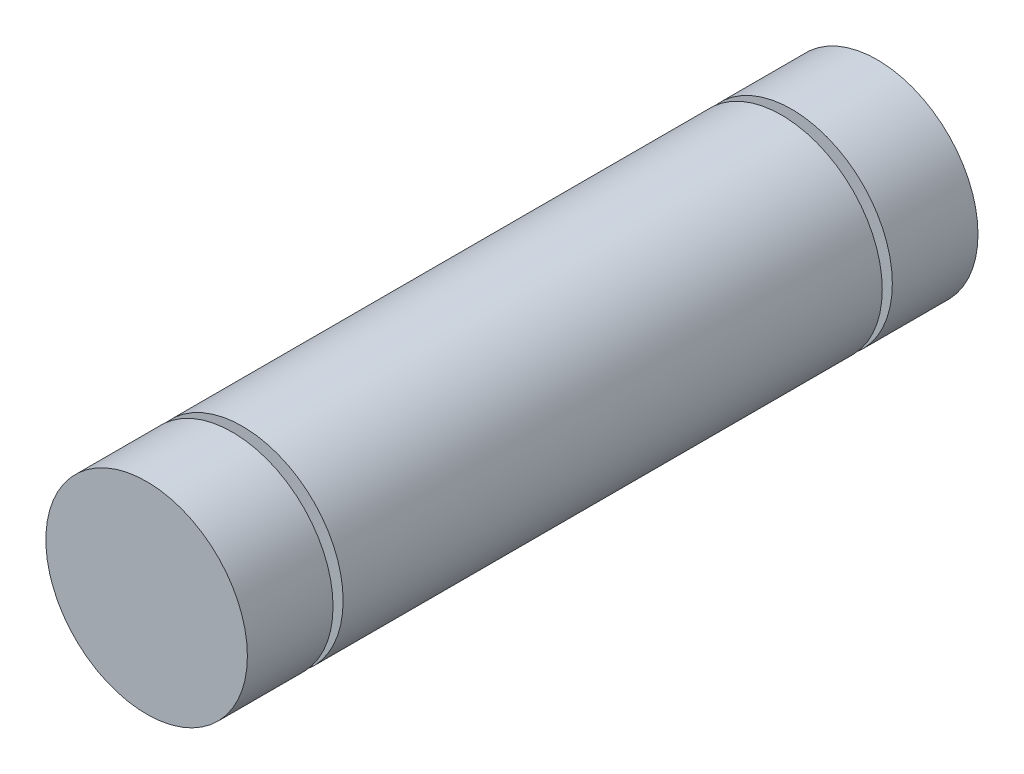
from build123d import *

# Parameters (mm, degrees)
ESQUISSE1_R        = 20
BOSS_EXTRU_1_DEPTH = 145
ESQUISSE2_W        = 3
ESQUISSE2_H        = 2


with BuildPart() as part:
    # Esquisse1 → Boss.-Extru.1 (new body)
    with BuildSketch(Plane.XY):
        Circle(ESQUISSE1_R)
    extrude(amount=BOSS_EXTRU_1_DEPTH)

    # Esquisse2 → Enl_vement de mati_re-R_volution2 (revolve, cut)
    with BuildSketch(Plane(origin=(0, 0, 0), x_dir=(1, 0, 0), z_dir=(0, 1, 0))):
        with Locations((18.5, -18)):
            Rectangle(ESQUISSE2_W, ESQUISSE2_H)
        with Locations((18.5, -127)):
            Rectangle(ESQUISSE2_W, ESQUISSE2_H)
    revolve(axis=Axis((0, 0, 144.18796275), (0, 0, -1)), mode=Mode.SUBTRACT)


solid = part.part
